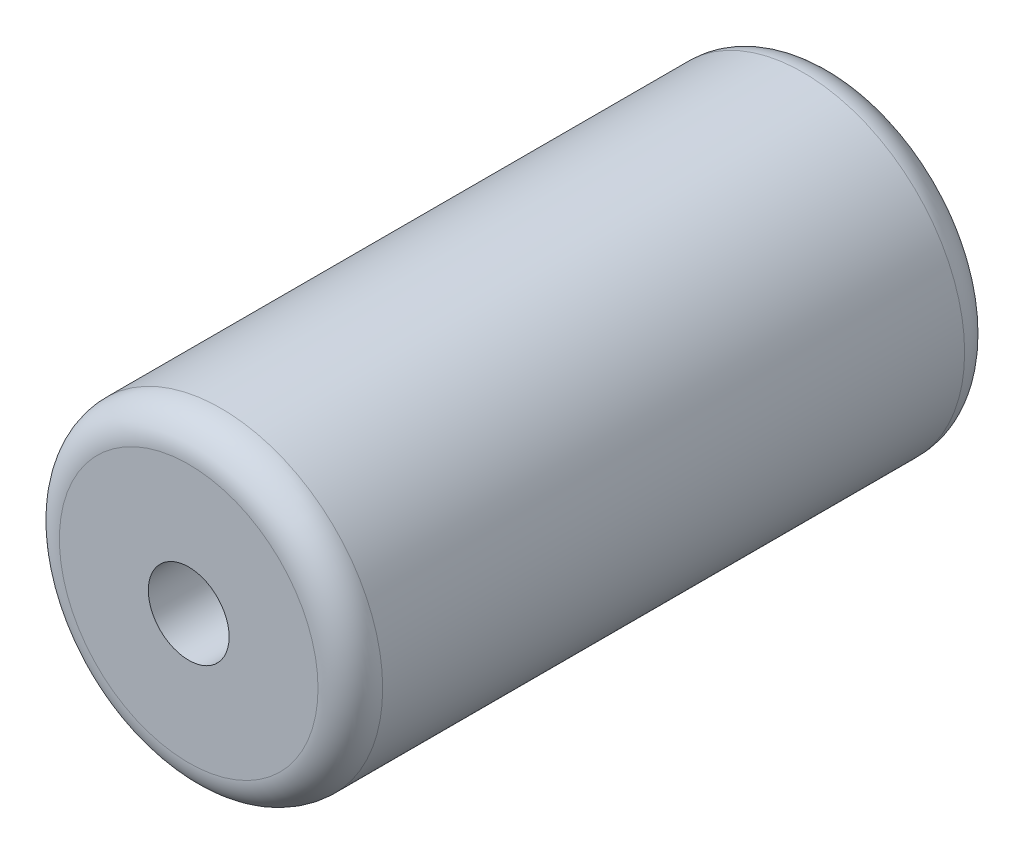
from build123d import *

# Parameters (mm, degrees)
SKETCH1_R           = 12.7
SKETCH1_R_2         = 3.175
BOSS_EXTRUDE1_DEPTH = 50.8
FILLET1_R           = 2.54


with BuildPart() as part:
    # Sketch1 → Boss-Extrude1 (new body)
    with BuildSketch(Plane.XY):
        Circle(SKETCH1_R)
        Circle(SKETCH1_R_2, mode=Mode.SUBTRACT)
    extrude(amount=BOSS_EXTRUDE1_DEPTH)

    # Fillet1
    fillet1_edges = [part.edges().sort_by_distance(p)[0] for p in [
        (-12.7, 0, 0),
        (-12.7, 0, 50.8),
    ]]
    fillet(fillet1_edges, radius=FILLET1_R)


solid = part.part
